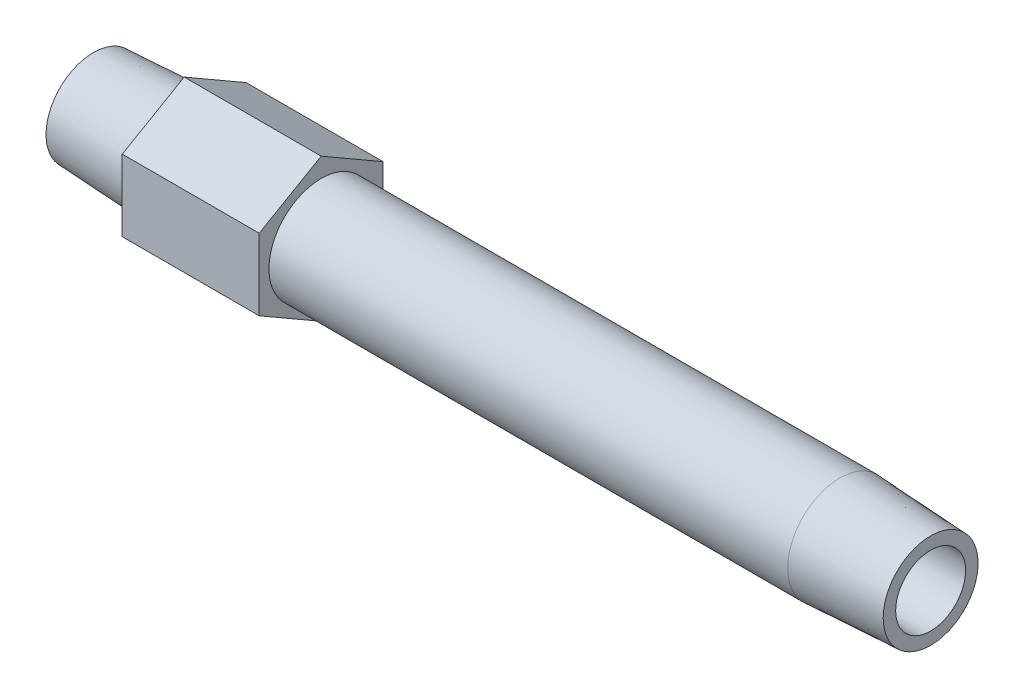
ISO-10303-21;
HEADER;
FILE_DESCRIPTION(('STEP AP214'),'2;1');
FILE_NAME('part.step','',(''),(''),'','','');
FILE_SCHEMA(('AUTOMOTIVE_DESIGN { 1 0 10303 214 1 1 1 1 }'));
ENDSEC;
DATA;
#1=APPLICATION_CONTEXT('core data for automotive mechanical design processes');
#2=APPLICATION_PROTOCOL_DEFINITION('international standard','automotive_design',2000,#1);
#3=PRODUCT_CONTEXT('',#1,'mechanical');
#4=PRODUCT('Part','Part','',(#3));
#5=PRODUCT_RELATED_PRODUCT_CATEGORY('part','',(#4));
#6=PRODUCT_DEFINITION_FORMATION('','',#4);
#7=PRODUCT_DEFINITION_CONTEXT('part definition',#1,'design');
#8=PRODUCT_DEFINITION('design','',#6,#7);
#9=PRODUCT_DEFINITION_SHAPE('','',#8);
#10=(LENGTH_UNIT() NAMED_UNIT(*) SI_UNIT(.MILLI.,.METRE.));
#11=(NAMED_UNIT(*) PLANE_ANGLE_UNIT() SI_UNIT($,.RADIAN.));
#12=(NAMED_UNIT(*) SI_UNIT($,.STERADIAN.) SOLID_ANGLE_UNIT());
#13=UNCERTAINTY_MEASURE_WITH_UNIT(LENGTH_MEASURE(1.E-05),#10,'distance_accuracy_value','');
#14=(GEOMETRIC_REPRESENTATION_CONTEXT(3) GLOBAL_UNCERTAINTY_ASSIGNED_CONTEXT((#13)) GLOBAL_UNIT_ASSIGNED_CONTEXT((#10,
#11,#12)) REPRESENTATION_CONTEXT('',''));
#15=CARTESIAN_POINT('',(0.,0.,0.));
#16=DIRECTION('',(0.,0.,1.));
#17=DIRECTION('',(1.,0.,0.));
#18=AXIS2_PLACEMENT_3D('',#15,#16,#17);
#19=CARTESIAN_POINT('',(0.,0.,-3.59899397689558));
#20=DIRECTION('',(1.,0.,0.));
#21=DIRECTION('',(0.,0.,-1.));
#22=AXIS2_PLACEMENT_3D('',#19,#20,#21);
#23=PLANE('',#22);
#24=CARTESIAN_POINT('',(0.,0.,0.));
#25=DIRECTION('',(-1.,0.,0.));
#26=DIRECTION('',(0.,0.,1.));
#27=AXIS2_PLACEMENT_3D('',#24,#25,#26);
#28=CIRCLE('',#27,3.59899397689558);
#29=CARTESIAN_POINT('',(0.,0.,3.59899397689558));
#30=VERTEX_POINT('',#29);
#31=EDGE_CURVE('E147',#30,#30,#28,.T.);
#32=ORIENTED_EDGE('',*,*,#31,.T.);
#33=EDGE_LOOP('',(#32));
#34=FACE_BOUND('',#33,.T.);
#35=CARTESIAN_POINT('',(0.,0.,0.));
#36=DIRECTION('',(1.,0.,0.));
#37=DIRECTION('',(0.,0.,1.));
#38=AXIS2_PLACEMENT_3D('',#35,#36,#37);
#39=CIRCLE('',#38,2.6543);
#40=CARTESIAN_POINT('',(0.,0.,2.6543));
#41=VERTEX_POINT('',#40);
#42=EDGE_CURVE('E159',#41,#41,#39,.T.);
#43=ORIENTED_EDGE('',*,*,#42,.T.);
#44=EDGE_LOOP('',(#43));
#45=FACE_BOUND('',#44,.T.);
#46=ADVANCED_FACE('F15',(#34,#45),#23,.F.);
#47=CARTESIAN_POINT('',(63.5,0.,-3.59899397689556));
#48=DIRECTION('',(-1.,0.,0.));
#49=DIRECTION('',(0.,0.,1.));
#50=AXIS2_PLACEMENT_3D('',#47,#48,#49);
#51=PLANE('',#50);
#52=CARTESIAN_POINT('',(63.5,0.,0.));
#53=DIRECTION('',(-1.,0.,0.));
#54=DIRECTION('',(0.,0.,1.));
#55=AXIS2_PLACEMENT_3D('',#52,#53,#54);
#56=CIRCLE('',#55,3.59899397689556);
#57=CARTESIAN_POINT('',(63.5,0.,3.59899397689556));
#58=VERTEX_POINT('',#57);
#59=EDGE_CURVE('E150',#58,#58,#56,.T.);
#60=ORIENTED_EDGE('',*,*,#59,.F.);
#61=EDGE_LOOP('',(#60));
#62=FACE_BOUND('',#61,.T.);
#63=CARTESIAN_POINT('',(63.5,0.,0.));
#64=DIRECTION('',(-1.,0.,0.));
#65=DIRECTION('',(0.,0.,1.));
#66=AXIS2_PLACEMENT_3D('',#63,#64,#65);
#67=CIRCLE('',#66,2.6543);
#68=CARTESIAN_POINT('',(63.5,0.,2.6543));
#69=VERTEX_POINT('',#68);
#70=EDGE_CURVE('E156',#69,#69,#67,.F.);
#71=ORIENTED_EDGE('',*,*,#70,.F.);
#72=EDGE_LOOP('',(#71));
#73=FACE_BOUND('',#72,.T.);
#74=ADVANCED_FACE('F178',(#62,#73),#51,.F.);
#75=CARTESIAN_POINT('',(17.272,-2.71296891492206,-4.699));
#76=DIRECTION('',(1.,0.,0.));
#77=DIRECTION('',(0.,1.,0.));
#78=AXIS2_PLACEMENT_3D('',#75,#76,#77);
#79=PLANE('',#78);
#80=DIRECTION('',(0.,0.5,-0.866025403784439));
#81=VECTOR('',#80,1.);
#82=CARTESIAN_POINT('',(17.272,-5.4259378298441,0.));
#83=LINE('',#82,#81);
#84=CARTESIAN_POINT('',(17.272,-5.4259378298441,0.));
#85=VERTEX_POINT('',#84);
#86=CARTESIAN_POINT('',(17.272,-2.71296891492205,-4.699));
#87=VERTEX_POINT('',#86);
#88=EDGE_CURVE('E103',#85,#87,#83,.T.);
#89=ORIENTED_EDGE('',*,*,#88,.T.);
#90=DIRECTION('',(0.,1.,0.));
#91=VECTOR('',#90,1.);
#92=CARTESIAN_POINT('',(17.272,-2.71296891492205,-4.699));
#93=LINE('',#92,#91);
#94=CARTESIAN_POINT('',(17.272,2.71296891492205,-4.699));
#95=VERTEX_POINT('',#94);
#96=EDGE_CURVE('E83',#87,#95,#93,.T.);
#97=ORIENTED_EDGE('',*,*,#96,.T.);
#98=DIRECTION('',(0.,0.5,0.866025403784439));
#99=VECTOR('',#98,1.);
#100=CARTESIAN_POINT('',(17.272,2.71296891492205,-4.699));
#101=LINE('',#100,#99);
#102=CARTESIAN_POINT('',(17.272,5.4259378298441,0.));
#103=VERTEX_POINT('',#102);
#104=EDGE_CURVE('E102',#95,#103,#101,.T.);
#105=ORIENTED_EDGE('',*,*,#104,.T.);
#106=DIRECTION('',(0.,-0.5,0.866025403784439));
#107=VECTOR('',#106,1.);
#108=CARTESIAN_POINT('',(17.272,5.4259378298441,0.));
#109=LINE('',#108,#107);
#110=CARTESIAN_POINT('',(17.272,2.71296891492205,4.699));
#111=VERTEX_POINT('',#110);
#112=EDGE_CURVE('E105',#103,#111,#109,.T.);
#113=ORIENTED_EDGE('',*,*,#112,.T.);
#114=DIRECTION('',(0.,-1.,0.));
#115=VECTOR('',#114,1.);
#116=CARTESIAN_POINT('',(17.272,2.71296891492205,4.699));
#117=LINE('',#116,#115);
#118=CARTESIAN_POINT('',(17.272,-2.71296891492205,4.699));
#119=VERTEX_POINT('',#118);
#120=EDGE_CURVE('E35',#111,#119,#117,.T.);
#121=ORIENTED_EDGE('',*,*,#120,.T.);
#122=DIRECTION('',(0.,-0.5,-0.866025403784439));
#123=VECTOR('',#122,1.);
#124=CARTESIAN_POINT('',(17.272,-2.71296891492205,4.699));
#125=LINE('',#124,#123);
#126=EDGE_CURVE('E30',#119,#85,#125,.T.);
#127=ORIENTED_EDGE('',*,*,#126,.T.);
#128=EDGE_LOOP('',(#89,#97,#105,#113,#121,#127));
#129=FACE_BOUND('',#128,.T.);
#130=CARTESIAN_POINT('',(17.272,0.,0.));
#131=DIRECTION('',(1.,0.,0.));
#132=DIRECTION('',(0.,1.,0.));
#133=AXIS2_PLACEMENT_3D('',#130,#131,#132);
#134=CIRCLE('',#133,3.95973768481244);
#135=CARTESIAN_POINT('',(17.272,3.95973768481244,0.));
#136=VERTEX_POINT('',#135);
#137=EDGE_CURVE('E89',#136,#136,#134,.F.);
#138=ORIENTED_EDGE('',*,*,#137,.T.);
#139=EDGE_LOOP('',(#138));
#140=FACE_BOUND('',#139,.T.);
#141=ADVANCED_FACE('F124',(#129,#140),#79,.T.);
#142=CARTESIAN_POINT('',(6.8834,-2.71296891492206,-4.699));
#143=DIRECTION('',(1.,0.,0.));
#144=DIRECTION('',(0.,1.,0.));
#145=AXIS2_PLACEMENT_3D('',#142,#143,#144);
#146=PLANE('',#145);
#147=DIRECTION('',(0.,0.5,-0.866025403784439));
#148=VECTOR('',#147,1.);
#149=CARTESIAN_POINT('',(6.8834,-5.4259378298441,0.));
#150=LINE('',#149,#148);
#151=CARTESIAN_POINT('',(6.8834,-5.4259378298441,0.));
#152=VERTEX_POINT('',#151);
#153=CARTESIAN_POINT('',(6.8834,-2.71296891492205,-4.699));
#154=VERTEX_POINT('',#153);
#155=EDGE_CURVE('E73',#152,#154,#150,.T.);
#156=ORIENTED_EDGE('',*,*,#155,.F.);
#157=DIRECTION('',(0.,-0.5,-0.866025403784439));
#158=VECTOR('',#157,1.);
#159=CARTESIAN_POINT('',(6.8834,-2.71296891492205,4.699));
#160=LINE('',#159,#158);
#161=CARTESIAN_POINT('',(6.8834,-2.71296891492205,4.699));
#162=VERTEX_POINT('',#161);
#163=EDGE_CURVE('E99',#162,#152,#160,.T.);
#164=ORIENTED_EDGE('',*,*,#163,.F.);
#165=DIRECTION('',(0.,-1.,0.));
#166=VECTOR('',#165,1.);
#167=CARTESIAN_POINT('',(6.8834,2.71296891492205,4.699));
#168=LINE('',#167,#166);
#169=CARTESIAN_POINT('',(6.8834,2.71296891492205,4.699));
#170=VERTEX_POINT('',#169);
#171=EDGE_CURVE('E133',#170,#162,#168,.T.);
#172=ORIENTED_EDGE('',*,*,#171,.F.);
#173=DIRECTION('',(0.,-0.5,0.866025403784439));
#174=VECTOR('',#173,1.);
#175=CARTESIAN_POINT('',(6.8834,5.4259378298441,0.));
#176=LINE('',#175,#174);
#177=CARTESIAN_POINT('',(6.8834,5.4259378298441,0.));
#178=VERTEX_POINT('',#177);
#179=EDGE_CURVE('E129',#178,#170,#176,.T.);
#180=ORIENTED_EDGE('',*,*,#179,.F.);
#181=DIRECTION('',(0.,0.5,0.866025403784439));
#182=VECTOR('',#181,1.);
#183=CARTESIAN_POINT('',(6.8834,2.71296891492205,-4.699));
#184=LINE('',#183,#182);
#185=CARTESIAN_POINT('',(6.8834,2.71296891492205,-4.699));
#186=VERTEX_POINT('',#185);
#187=EDGE_CURVE('E75',#186,#178,#184,.T.);
#188=ORIENTED_EDGE('',*,*,#187,.F.);
#189=DIRECTION('',(0.,1.,0.));
#190=VECTOR('',#189,1.);
#191=CARTESIAN_POINT('',(6.8834,-2.71296891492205,-4.699));
#192=LINE('',#191,#190);
#193=EDGE_CURVE('E68',#154,#186,#192,.T.);
#194=ORIENTED_EDGE('',*,*,#193,.F.);
#195=EDGE_LOOP('',(#156,#164,#172,#180,#188,#194));
#196=FACE_BOUND('',#195,.T.);
#197=CARTESIAN_POINT('',(6.8834,0.,0.));
#198=DIRECTION('',(-1.,0.,0.));
#199=DIRECTION('',(0.,0.,1.));
#200=AXIS2_PLACEMENT_3D('',#197,#198,#199);
#201=CIRCLE('',#200,3.95973768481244);
#202=CARTESIAN_POINT('',(6.8834,0.,3.95973768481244));
#203=VERTEX_POINT('',#202);
#204=EDGE_CURVE('E95',#203,#203,#201,.T.);
#205=ORIENTED_EDGE('',*,*,#204,.F.);
#206=EDGE_LOOP('',(#205));
#207=FACE_BOUND('',#206,.T.);
#208=ADVANCED_FACE('F69',(#196,#207),#146,.F.);
#209=CARTESIAN_POINT('',(17.272,-5.4259378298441,0.));
#210=DIRECTION('',(0.,0.866025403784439,0.5));
#211=DIRECTION('',(0.,-0.5,0.866025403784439));
#212=AXIS2_PLACEMENT_3D('',#209,#210,#211);
#213=PLANE('',#212);
#214=ORIENTED_EDGE('',*,*,#155,.T.);
#215=DIRECTION('',(-1.,0.,0.));
#216=VECTOR('',#215,1.);
#217=CARTESIAN_POINT('',(17.272,-2.71296891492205,-4.699));
#218=LINE('',#217,#216);
#219=EDGE_CURVE('E10',#87,#154,#218,.T.);
#220=ORIENTED_EDGE('',*,*,#219,.F.);
#221=ORIENTED_EDGE('',*,*,#88,.F.);
#222=DIRECTION('',(-1.,0.,0.));
#223=VECTOR('',#222,1.);
#224=CARTESIAN_POINT('',(17.272,-5.4259378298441,0.));
#225=LINE('',#224,#223);
#226=EDGE_CURVE('E87',#85,#152,#225,.T.);
#227=ORIENTED_EDGE('',*,*,#226,.T.);
#228=EDGE_LOOP('',(#214,#220,#221,#227));
#229=FACE_BOUND('',#228,.T.);
#230=ADVANCED_FACE('F17',(#229),#213,.F.);
#231=CARTESIAN_POINT('',(17.272,-2.71296891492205,-4.699));
#232=DIRECTION('',(0.,0.,1.));
#233=DIRECTION('',(1.,0.,0.));
#234=AXIS2_PLACEMENT_3D('',#231,#232,#233);
#235=PLANE('',#234);
#236=ORIENTED_EDGE('',*,*,#193,.T.);
#237=DIRECTION('',(-1.,0.,0.));
#238=VECTOR('',#237,1.);
#239=CARTESIAN_POINT('',(17.272,2.71296891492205,-4.699));
#240=LINE('',#239,#238);
#241=EDGE_CURVE('E23',#95,#186,#240,.T.);
#242=ORIENTED_EDGE('',*,*,#241,.F.);
#243=ORIENTED_EDGE('',*,*,#96,.F.);
#244=ORIENTED_EDGE('',*,*,#219,.T.);
#245=EDGE_LOOP('',(#236,#242,#243,#244));
#246=FACE_BOUND('',#245,.T.);
#247=ADVANCED_FACE('F82',(#246),#235,.F.);
#248=CARTESIAN_POINT('',(17.272,2.71296891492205,-4.699));
#249=DIRECTION('',(0.,-0.866025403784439,0.5));
#250=DIRECTION('',(0.,-0.5,-0.866025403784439));
#251=AXIS2_PLACEMENT_3D('',#248,#249,#250);
#252=PLANE('',#251);
#253=ORIENTED_EDGE('',*,*,#187,.T.);
#254=DIRECTION('',(-1.,0.,0.));
#255=VECTOR('',#254,1.);
#256=CARTESIAN_POINT('',(17.272,5.4259378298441,0.));
#257=LINE('',#256,#255);
#258=EDGE_CURVE('E117',#103,#178,#257,.T.);
#259=ORIENTED_EDGE('',*,*,#258,.F.);
#260=ORIENTED_EDGE('',*,*,#104,.F.);
#261=ORIENTED_EDGE('',*,*,#241,.T.);
#262=EDGE_LOOP('',(#253,#259,#260,#261));
#263=FACE_BOUND('',#262,.T.);
#264=ADVANCED_FACE('F121',(#263),#252,.F.);
#265=CARTESIAN_POINT('',(17.272,5.4259378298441,0.));
#266=DIRECTION('',(0.,-0.866025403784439,-0.5));
#267=DIRECTION('',(0.,0.5,-0.866025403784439));
#268=AXIS2_PLACEMENT_3D('',#265,#266,#267);
#269=PLANE('',#268);
#270=ORIENTED_EDGE('',*,*,#179,.T.);
#271=DIRECTION('',(-1.,0.,0.));
#272=VECTOR('',#271,1.);
#273=CARTESIAN_POINT('',(17.272,2.71296891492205,4.699));
#274=LINE('',#273,#272);
#275=EDGE_CURVE('E114',#111,#170,#274,.T.);
#276=ORIENTED_EDGE('',*,*,#275,.F.);
#277=ORIENTED_EDGE('',*,*,#112,.F.);
#278=ORIENTED_EDGE('',*,*,#258,.T.);
#279=EDGE_LOOP('',(#270,#276,#277,#278));
#280=FACE_BOUND('',#279,.T.);
#281=ADVANCED_FACE('F128',(#280),#269,.F.);
#282=CARTESIAN_POINT('',(17.272,2.71296891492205,4.699));
#283=DIRECTION('',(0.,0.,-1.));
#284=DIRECTION('',(-1.,0.,0.));
#285=AXIS2_PLACEMENT_3D('',#282,#283,#284);
#286=PLANE('',#285);
#287=ORIENTED_EDGE('',*,*,#171,.T.);
#288=DIRECTION('',(-1.,0.,0.));
#289=VECTOR('',#288,1.);
#290=CARTESIAN_POINT('',(17.272,-2.71296891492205,4.699));
#291=LINE('',#290,#289);
#292=EDGE_CURVE('E111',#119,#162,#291,.T.);
#293=ORIENTED_EDGE('',*,*,#292,.F.);
#294=ORIENTED_EDGE('',*,*,#120,.F.);
#295=ORIENTED_EDGE('',*,*,#275,.T.);
#296=EDGE_LOOP('',(#287,#293,#294,#295));
#297=FACE_BOUND('',#296,.T.);
#298=ADVANCED_FACE('F132',(#297),#286,.F.);
#299=CARTESIAN_POINT('',(17.272,-2.71296891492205,4.699));
#300=DIRECTION('',(0.,0.866025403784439,-0.5));
#301=DIRECTION('',(0.,0.5,0.866025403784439));
#302=AXIS2_PLACEMENT_3D('',#299,#300,#301);
#303=PLANE('',#302);
#304=ORIENTED_EDGE('',*,*,#163,.T.);
#305=ORIENTED_EDGE('',*,*,#226,.F.);
#306=ORIENTED_EDGE('',*,*,#126,.F.);
#307=ORIENTED_EDGE('',*,*,#292,.T.);
#308=EDGE_LOOP('',(#304,#305,#306,#307));
#309=FACE_BOUND('',#308,.T.);
#310=ADVANCED_FACE('F135',(#309),#303,.F.);
#311=CARTESIAN_POINT('',(6.8834,0.,0.));
#312=DIRECTION('',(1.,0.,0.));
#313=DIRECTION('',(0.,0.,-1.));
#314=AXIS2_PLACEMENT_3D('',#311,#312,#313);
#315=CONICAL_SURFACE('',#314,3.95973768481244,0.0523598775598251);
#316=ORIENTED_EDGE('',*,*,#31,.F.);
#317=EDGE_LOOP('',(#316));
#318=FACE_BOUND('',#317,.T.);
#319=ORIENTED_EDGE('',*,*,#204,.T.);
#320=EDGE_LOOP('',(#319));
#321=FACE_BOUND('',#320,.T.);
#322=ADVANCED_FACE('F187',(#318,#321),#315,.T.);
#323=CARTESIAN_POINT('',(-60.,0.,0.));
#324=DIRECTION('',(-1.,0.,0.));
#325=DIRECTION('',(0.,0.,1.));
#326=AXIS2_PLACEMENT_3D('',#323,#324,#325);
#327=CYLINDRICAL_SURFACE('',#326,3.95973768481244);
#328=ORIENTED_EDGE('',*,*,#137,.F.);
#329=EDGE_LOOP('',(#328));
#330=FACE_BOUND('',#329,.T.);
#331=CARTESIAN_POINT('',(56.6166,0.,0.));
#332=DIRECTION('',(-1.,0.,0.));
#333=DIRECTION('',(0.,0.,1.));
#334=AXIS2_PLACEMENT_3D('',#331,#332,#333);
#335=CIRCLE('',#334,3.95973768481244);
#336=CARTESIAN_POINT('',(56.6166,0.,3.95973768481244));
#337=VERTEX_POINT('',#336);
#338=EDGE_CURVE('E153',#337,#337,#335,.T.);
#339=ORIENTED_EDGE('',*,*,#338,.T.);
#340=EDGE_LOOP('',(#339));
#341=FACE_BOUND('',#340,.T.);
#342=ADVANCED_FACE('F174',(#330,#341),#327,.T.);
#343=CARTESIAN_POINT('',(63.5,0.,0.));
#344=DIRECTION('',(-1.,0.,0.));
#345=DIRECTION('',(0.,0.,1.));
#346=AXIS2_PLACEMENT_3D('',#343,#344,#345);
#347=CONICAL_SURFACE('',#346,3.59899397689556,0.0523598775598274);
#348=ORIENTED_EDGE('',*,*,#338,.F.);
#349=EDGE_LOOP('',(#348));
#350=FACE_BOUND('',#349,.T.);
#351=ORIENTED_EDGE('',*,*,#59,.T.);
#352=EDGE_LOOP('',(#351));
#353=FACE_BOUND('',#352,.T.);
#354=ADVANCED_FACE('F167',(#350,#353),#347,.T.);
#355=CARTESIAN_POINT('',(65.1025007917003,0.,0.));
#356=DIRECTION('',(-1.,0.,0.));
#357=DIRECTION('',(0.,0.,1.));
#358=AXIS2_PLACEMENT_3D('',#355,#356,#357);
#359=CYLINDRICAL_SURFACE('',#358,2.6543);
#360=ORIENTED_EDGE('',*,*,#70,.T.);
#361=EDGE_LOOP('',(#360));
#362=FACE_BOUND('',#361,.T.);
#363=ORIENTED_EDGE('',*,*,#42,.F.);
#364=EDGE_LOOP('',(#363));
#365=FACE_BOUND('',#364,.T.);
#366=ADVANCED_FACE('F165',(#362,#365),#359,.F.);
#367=CLOSED_SHELL('',(#46,#74,#141,#208,#230,#247,#264,#281,#298,#310,#322,#342,#354,#366));
#368=MANIFOLD_SOLID_BREP('B1',#367);
#369=ADVANCED_BREP_SHAPE_REPRESENTATION('',(#18,#368),#14);
#370=SHAPE_DEFINITION_REPRESENTATION(#9,#369);
ENDSEC;
END-ISO-10303-21;
